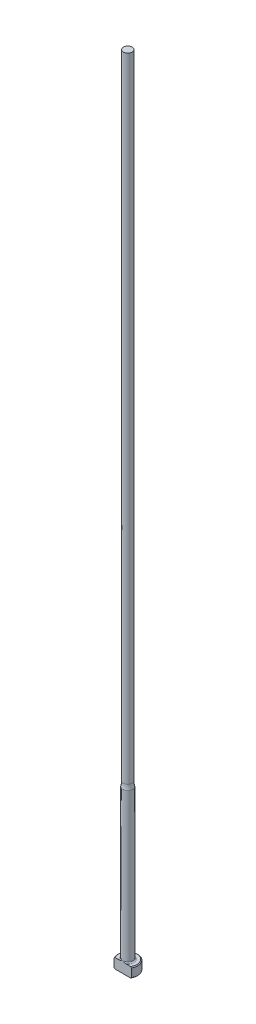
from build123d import *

# Parameters (mm, degrees)
CHAMFER1_SIZE = 0.254
FILLET1_R     = 0.381
KEY_DEPTH     = 255.0396844


with BuildPart() as part:
    # Sketch1 → Revolve1 (revolve)
    with BuildSketch(Plane.XY, mode=Mode.PRIVATE) as revolve1_sk:
        with BuildLine():
            Line((0, 0), (-3.175, 0))
            Line((-3.175, 0), (-3.175, 3.175))
            Line((-3.175, 3.175), (-1.5875, 3.175))
            Line((-1.5875, 3.175), (-1.5875, 50.8))
            ThreePointArc((-1.5875, 50.8), (-1.438154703, 51.583111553), (-1.38811, 52.378764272))
            Line((-1.38811, 52.378764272), (-1.38811, 254))
            Line((-1.38811, 254), (0, 254))
            Line((0, 254), (0, 0))
        make_face()
    revolve(revolve1_sk.sketch.rotate(Axis((0, 259.958771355, 0), (0, -1, 0)), 270), axis=Axis((0, 259.958771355, 0), (0, -1, 0)))

    # Chamfer1
    chamfer1_edges = [part.edges().sort_by_distance(p)[0] for p in [
        (0, 0, -3.175),
        (0, 3.175, -3.175),
    ]]
    chamfer(chamfer1_edges, length=CHAMFER1_SIZE)

    # Fillet1
    fillet1_edges = [part.edges().sort_by_distance(p)[0] for p in [
        (0, 3.175, -1.5875),
    ]]
    fillet(fillet1_edges, radius=FILLET1_R)

    # Sketch2 → KEY (cut, through all)
    with BuildSketch(Plane.XZ):
        with BuildLine():
            Line((-2.749630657, 1.5875), (2.749630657, 1.5875))
            ThreePointArc((2.749630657, 1.5875), (0, 3.175), (-2.749630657, 1.5875))
        make_face()
    extrude(amount=-KEY_DEPTH, mode=Mode.SUBTRACT)


solid = part.part
